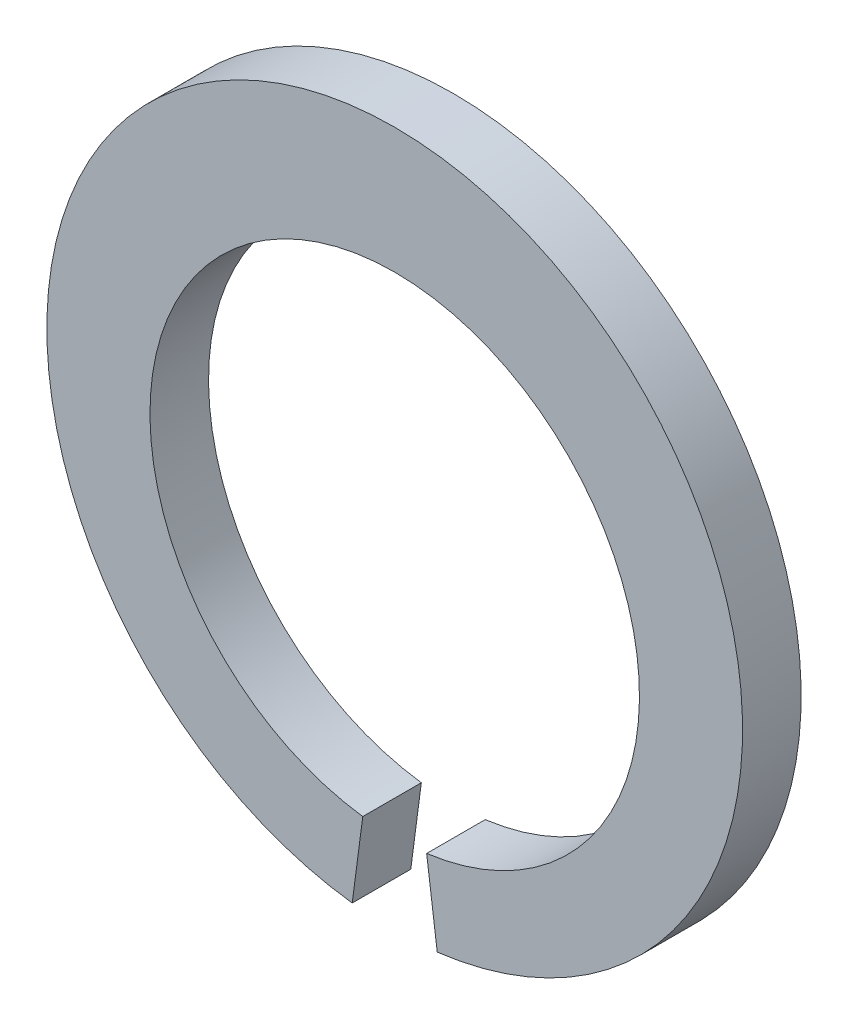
ISO-10303-21;
HEADER;
FILE_DESCRIPTION(('STEP AP214'),'2;1');
FILE_NAME('part.step','',(''),(''),'','','');
FILE_SCHEMA(('AUTOMOTIVE_DESIGN { 1 0 10303 214 1 1 1 1 }'));
ENDSEC;
DATA;
#1=APPLICATION_CONTEXT('core data for automotive mechanical design processes');
#2=APPLICATION_PROTOCOL_DEFINITION('international standard','automotive_design',2000,#1);
#3=PRODUCT_CONTEXT('',#1,'mechanical');
#4=PRODUCT('Part','Part','',(#3));
#5=PRODUCT_RELATED_PRODUCT_CATEGORY('part','',(#4));
#6=PRODUCT_DEFINITION_FORMATION('','',#4);
#7=PRODUCT_DEFINITION_CONTEXT('part definition',#1,'design');
#8=PRODUCT_DEFINITION('design','',#6,#7);
#9=PRODUCT_DEFINITION_SHAPE('','',#8);
#10=(LENGTH_UNIT() NAMED_UNIT(*) SI_UNIT(.MILLI.,.METRE.));
#11=(NAMED_UNIT(*) PLANE_ANGLE_UNIT() SI_UNIT($,.RADIAN.));
#12=(NAMED_UNIT(*) SI_UNIT($,.STERADIAN.) SOLID_ANGLE_UNIT());
#13=UNCERTAINTY_MEASURE_WITH_UNIT(LENGTH_MEASURE(1.E-05),#10,'distance_accuracy_value','');
#14=(GEOMETRIC_REPRESENTATION_CONTEXT(3) GLOBAL_UNCERTAINTY_ASSIGNED_CONTEXT((#13)) GLOBAL_UNIT_ASSIGNED_CONTEXT((#10,
#11,#12)) REPRESENTATION_CONTEXT('',''));
#15=CARTESIAN_POINT('',(0.,0.,0.));
#16=DIRECTION('',(0.,0.,1.));
#17=DIRECTION('',(1.,0.,0.));
#18=AXIS2_PLACEMENT_3D('',#15,#16,#17);
#19=CARTESIAN_POINT('',(0.,0.,-1.0668));
#20=DIRECTION('',(0.,0.,1.));
#21=DIRECTION('',(1.,0.,0.));
#22=AXIS2_PLACEMENT_3D('',#19,#20,#21);
#23=CYLINDRICAL_SURFACE('',#22,4.4577);
#24=CARTESIAN_POINT('',(0.,0.,0.));
#25=DIRECTION('',(0.,0.,-1.));
#26=DIRECTION('',(1.,0.,0.));
#27=AXIS2_PLACEMENT_3D('',#24,#25,#26);
#28=CIRCLE('',#27,4.4577);
#29=CARTESIAN_POINT('',(-0.581846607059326,-4.41956375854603,0.));
#30=VERTEX_POINT('',#29);
#31=CARTESIAN_POINT('',(0.581846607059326,-4.41956375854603,0.));
#32=VERTEX_POINT('',#31);
#33=EDGE_CURVE('E103',#30,#32,#28,.T.);
#34=ORIENTED_EDGE('',*,*,#33,.F.);
#35=DIRECTION('',(0.,0.,1.));
#36=VECTOR('',#35,1.);
#37=CARTESIAN_POINT('',(-0.581846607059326,-4.41956375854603,-1.0668));
#38=LINE('',#37,#36);
#39=CARTESIAN_POINT('',(-0.581846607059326,-4.41956375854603,-1.0668));
#40=VERTEX_POINT('',#39);
#41=EDGE_CURVE('E11',#40,#30,#38,.T.);
#42=ORIENTED_EDGE('',*,*,#41,.F.);
#43=CARTESIAN_POINT('',(0.,0.,-1.0668));
#44=DIRECTION('',(0.,0.,-1.));
#45=DIRECTION('',(1.,0.,0.));
#46=AXIS2_PLACEMENT_3D('',#43,#44,#45);
#47=CIRCLE('',#46,4.4577);
#48=CARTESIAN_POINT('',(0.581846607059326,-4.41956375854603,-1.0668));
#49=VERTEX_POINT('',#48);
#50=EDGE_CURVE('E97',#40,#49,#47,.T.);
#51=ORIENTED_EDGE('',*,*,#50,.T.);
#52=DIRECTION('',(0.,0.,1.));
#53=VECTOR('',#52,1.);
#54=CARTESIAN_POINT('',(0.581846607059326,-4.41956375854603,-1.0668));
#55=LINE('',#54,#53);
#56=EDGE_CURVE('E42',#49,#32,#55,.T.);
#57=ORIENTED_EDGE('',*,*,#56,.T.);
#58=EDGE_LOOP('',(#34,#42,#51,#57));
#59=FACE_BOUND('',#58,.T.);
#60=ADVANCED_FACE('F39',(#59),#23,.F.);
#61=CARTESIAN_POINT('',(-0.581846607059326,-4.41956375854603,-1.0668));
#62=DIRECTION('',(0.99144486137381,-0.130526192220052,0.));
#63=DIRECTION('',(0.130526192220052,0.99144486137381,0.));
#64=AXIS2_PLACEMENT_3D('',#61,#62,#63);
#65=PLANE('',#64);
#66=DIRECTION('',(0.130526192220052,0.99144486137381,0.));
#67=VECTOR('',#66,1.);
#68=CARTESIAN_POINT('',(-0.581846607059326,-4.41956375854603,0.));
#69=LINE('',#68,#67);
#70=CARTESIAN_POINT('',(-0.774137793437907,-5.88016032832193,0.));
#71=VERTEX_POINT('',#70);
#72=EDGE_CURVE('E99',#71,#30,#69,.T.);
#73=ORIENTED_EDGE('',*,*,#72,.F.);
#74=DIRECTION('',(0.,0.,1.));
#75=VECTOR('',#74,1.);
#76=CARTESIAN_POINT('',(-0.774137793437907,-5.88016032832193,-1.0668));
#77=LINE('',#76,#75);
#78=CARTESIAN_POINT('',(-0.774137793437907,-5.88016032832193,-1.0668));
#79=VERTEX_POINT('',#78);
#80=EDGE_CURVE('E48',#79,#71,#77,.T.);
#81=ORIENTED_EDGE('',*,*,#80,.F.);
#82=DIRECTION('',(0.130526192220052,0.99144486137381,0.));
#83=VECTOR('',#82,1.);
#84=CARTESIAN_POINT('',(-0.581846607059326,-4.41956375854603,-1.0668));
#85=LINE('',#84,#83);
#86=EDGE_CURVE('E94',#79,#40,#85,.T.);
#87=ORIENTED_EDGE('',*,*,#86,.T.);
#88=ORIENTED_EDGE('',*,*,#41,.T.);
#89=EDGE_LOOP('',(#73,#81,#87,#88));
#90=FACE_BOUND('',#89,.T.);
#91=ADVANCED_FACE('F113',(#90),#65,.T.);
#92=CARTESIAN_POINT('',(0.,0.408033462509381,-1.0668));
#93=DIRECTION('',(0.,0.,1.));
#94=DIRECTION('',(1.,0.,0.));
#95=AXIS2_PLACEMENT_3D('',#92,#93,#94);
#96=CYLINDRICAL_SURFACE('',#95,6.33566653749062);
#97=CARTESIAN_POINT('',(0.,0.408033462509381,0.));
#98=DIRECTION('',(0.,0.,1.));
#99=DIRECTION('',(1.,0.,0.));
#100=AXIS2_PLACEMENT_3D('',#97,#98,#99);
#101=CIRCLE('',#100,6.33566653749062);
#102=CARTESIAN_POINT('',(0.774137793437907,-5.88016032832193,0.));
#103=VERTEX_POINT('',#102);
#104=EDGE_CURVE('E89',#103,#71,#101,.T.);
#105=ORIENTED_EDGE('',*,*,#104,.F.);
#106=DIRECTION('',(0.,0.,1.));
#107=VECTOR('',#106,1.);
#108=CARTESIAN_POINT('',(0.774137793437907,-5.88016032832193,-1.0668));
#109=LINE('',#108,#107);
#110=CARTESIAN_POINT('',(0.774137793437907,-5.88016032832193,-1.0668));
#111=VERTEX_POINT('',#110);
#112=EDGE_CURVE('E84',#111,#103,#109,.T.);
#113=ORIENTED_EDGE('',*,*,#112,.F.);
#114=CARTESIAN_POINT('',(0.,0.408033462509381,-1.0668));
#115=DIRECTION('',(0.,0.,1.));
#116=DIRECTION('',(1.,0.,0.));
#117=AXIS2_PLACEMENT_3D('',#114,#115,#116);
#118=CIRCLE('',#117,6.33566653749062);
#119=EDGE_CURVE('E87',#111,#79,#118,.T.);
#120=ORIENTED_EDGE('',*,*,#119,.T.);
#121=ORIENTED_EDGE('',*,*,#80,.T.);
#122=EDGE_LOOP('',(#105,#113,#120,#121));
#123=FACE_BOUND('',#122,.T.);
#124=ADVANCED_FACE('F86',(#123),#96,.T.);
#125=CARTESIAN_POINT('',(0.581846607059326,-4.41956375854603,-1.0668));
#126=DIRECTION('',(-0.99144486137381,-0.130526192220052,0.));
#127=DIRECTION('',(0.130526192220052,-0.99144486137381,0.));
#128=AXIS2_PLACEMENT_3D('',#125,#126,#127);
#129=PLANE('',#128);
#130=DIRECTION('',(0.130526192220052,-0.99144486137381,0.));
#131=VECTOR('',#130,1.);
#132=CARTESIAN_POINT('',(0.581846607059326,-4.41956375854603,0.));
#133=LINE('',#132,#131);
#134=EDGE_CURVE('E106',#32,#103,#133,.T.);
#135=ORIENTED_EDGE('',*,*,#134,.F.);
#136=ORIENTED_EDGE('',*,*,#56,.F.);
#137=DIRECTION('',(0.130526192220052,-0.99144486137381,0.));
#138=VECTOR('',#137,1.);
#139=CARTESIAN_POINT('',(0.581846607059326,-4.41956375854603,-1.0668));
#140=LINE('',#139,#138);
#141=EDGE_CURVE('E93',#49,#111,#140,.T.);
#142=ORIENTED_EDGE('',*,*,#141,.T.);
#143=ORIENTED_EDGE('',*,*,#112,.T.);
#144=EDGE_LOOP('',(#135,#136,#142,#143));
#145=FACE_BOUND('',#144,.T.);
#146=ADVANCED_FACE('F96',(#145),#129,.T.);
#147=CARTESIAN_POINT('',(0.,0.,-1.0668));
#148=DIRECTION('',(0.,0.,1.));
#149=DIRECTION('',(1.,0.,0.));
#150=AXIS2_PLACEMENT_3D('',#147,#148,#149);
#151=PLANE('',#150);
#152=ORIENTED_EDGE('',*,*,#50,.F.);
#153=ORIENTED_EDGE('',*,*,#86,.F.);
#154=ORIENTED_EDGE('',*,*,#119,.F.);
#155=ORIENTED_EDGE('',*,*,#141,.F.);
#156=EDGE_LOOP('',(#152,#153,#154,#155));
#157=FACE_BOUND('',#156,.T.);
#158=ADVANCED_FACE('F92',(#157),#151,.F.);
#159=CARTESIAN_POINT('',(0.,0.,0.));
#160=DIRECTION('',(0.,0.,1.));
#161=DIRECTION('',(1.,0.,0.));
#162=AXIS2_PLACEMENT_3D('',#159,#160,#161);
#163=PLANE('',#162);
#164=ORIENTED_EDGE('',*,*,#33,.T.);
#165=ORIENTED_EDGE('',*,*,#134,.T.);
#166=ORIENTED_EDGE('',*,*,#104,.T.);
#167=ORIENTED_EDGE('',*,*,#72,.T.);
#168=EDGE_LOOP('',(#164,#165,#166,#167));
#169=FACE_BOUND('',#168,.T.);
#170=ADVANCED_FACE('F112',(#169),#163,.T.);
#171=CLOSED_SHELL('',(#60,#91,#124,#146,#158,#170));
#172=MANIFOLD_SOLID_BREP('B2',#171);
#173=ADVANCED_BREP_SHAPE_REPRESENTATION('',(#18,#172),#14);
#174=SHAPE_DEFINITION_REPRESENTATION(#9,#173);
ENDSEC;
END-ISO-10303-21;
